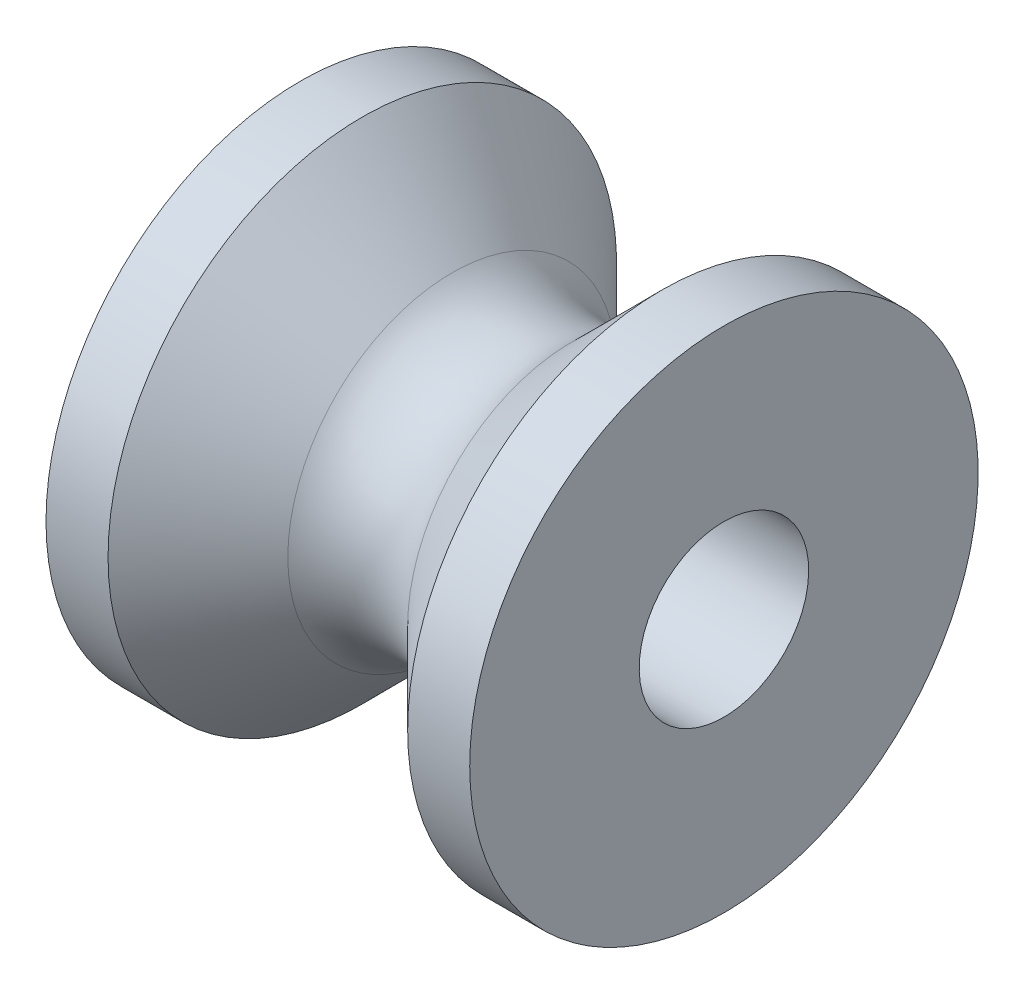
ISO-10303-21;
HEADER;
FILE_DESCRIPTION(('STEP AP214'),'2;1');
FILE_NAME('part.step','',(''),(''),'','','');
FILE_SCHEMA(('AUTOMOTIVE_DESIGN { 1 0 10303 214 1 1 1 1 }'));
ENDSEC;
DATA;
#1=APPLICATION_CONTEXT('core data for automotive mechanical design processes');
#2=APPLICATION_PROTOCOL_DEFINITION('international standard','automotive_design',2000,#1);
#3=PRODUCT_CONTEXT('',#1,'mechanical');
#4=PRODUCT('Part','Part','',(#3));
#5=PRODUCT_RELATED_PRODUCT_CATEGORY('part','',(#4));
#6=PRODUCT_DEFINITION_FORMATION('','',#4);
#7=PRODUCT_DEFINITION_CONTEXT('part definition',#1,'design');
#8=PRODUCT_DEFINITION('design','',#6,#7);
#9=PRODUCT_DEFINITION_SHAPE('','',#8);
#10=(LENGTH_UNIT() NAMED_UNIT(*) SI_UNIT(.MILLI.,.METRE.));
#11=(NAMED_UNIT(*) PLANE_ANGLE_UNIT() SI_UNIT($,.RADIAN.));
#12=(NAMED_UNIT(*) SI_UNIT($,.STERADIAN.) SOLID_ANGLE_UNIT());
#13=UNCERTAINTY_MEASURE_WITH_UNIT(LENGTH_MEASURE(1.E-05),#10,'distance_accuracy_value','');
#14=(GEOMETRIC_REPRESENTATION_CONTEXT(3) GLOBAL_UNCERTAINTY_ASSIGNED_CONTEXT((#13)) GLOBAL_UNIT_ASSIGNED_CONTEXT((#10,
#11,#12)) REPRESENTATION_CONTEXT('',''));
#15=CARTESIAN_POINT('',(0.,0.,0.));
#16=DIRECTION('',(0.,0.,1.));
#17=DIRECTION('',(1.,0.,0.));
#18=AXIS2_PLACEMENT_3D('',#15,#16,#17);
#19=CARTESIAN_POINT('',(0.,0.,0.));
#20=DIRECTION('',(-1.,0.,0.));
#21=DIRECTION('',(0.,0.,1.));
#22=AXIS2_PLACEMENT_3D('',#19,#20,#21);
#23=CONICAL_SURFACE('',#22,2.46446609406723,0.785398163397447);
#24=CARTESIAN_POINT('',(-1.41421356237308,0.,0.));
#25=DIRECTION('',(-1.,0.,0.));
#26=DIRECTION('',(0.,0.,1.));
#27=AXIS2_PLACEMENT_3D('',#24,#25,#26);
#28=CIRCLE('',#27,3.87867965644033);
#29=CARTESIAN_POINT('',(-1.41421356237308,0.,3.87867965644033));
#30=VERTEX_POINT('',#29);
#31=EDGE_CURVE('E38',#30,#30,#28,.T.);
#32=ORIENTED_EDGE('',*,*,#31,.T.);
#33=EDGE_LOOP('',(#32));
#34=FACE_BOUND('',#33,.T.);
#35=CARTESIAN_POINT('',(-3.53553390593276,0.,0.));
#36=DIRECTION('',(-1.,0.,0.));
#37=DIRECTION('',(0.,0.,1.));
#38=AXIS2_PLACEMENT_3D('',#35,#36,#37);
#39=CIRCLE('',#38,6.);
#40=CARTESIAN_POINT('',(-3.53553390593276,0.,6.));
#41=VERTEX_POINT('',#40);
#42=EDGE_CURVE('E54',#41,#41,#39,.T.);
#43=ORIENTED_EDGE('',*,*,#42,.F.);
#44=EDGE_LOOP('',(#43));
#45=FACE_BOUND('',#44,.T.);
#46=ADVANCED_FACE('F31',(#34,#45),#23,.T.);
#47=CARTESIAN_POINT('',(3.53553390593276,0.,0.));
#48=DIRECTION('',(1.,0.,0.));
#49=DIRECTION('',(0.,0.,-1.));
#50=AXIS2_PLACEMENT_3D('',#47,#48,#49);
#51=CONICAL_SURFACE('',#50,6.,0.785398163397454);
#52=CARTESIAN_POINT('',(1.41421356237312,0.,0.));
#53=DIRECTION('',(1.,0.,0.));
#54=DIRECTION('',(0.,0.,-1.));
#55=AXIS2_PLACEMENT_3D('',#52,#53,#54);
#56=CIRCLE('',#55,3.87867965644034);
#57=CARTESIAN_POINT('',(1.41421356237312,0.,-3.87867965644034));
#58=VERTEX_POINT('',#57);
#59=EDGE_CURVE('E10',#58,#58,#56,.T.);
#60=ORIENTED_EDGE('',*,*,#59,.T.);
#61=EDGE_LOOP('',(#60));
#62=FACE_BOUND('',#61,.T.);
#63=CARTESIAN_POINT('',(3.53553390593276,0.,0.));
#64=DIRECTION('',(-1.,0.,0.));
#65=DIRECTION('',(0.,0.,1.));
#66=AXIS2_PLACEMENT_3D('',#63,#64,#65);
#67=CIRCLE('',#66,6.);
#68=CARTESIAN_POINT('',(3.53553390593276,0.,6.));
#69=VERTEX_POINT('',#68);
#70=EDGE_CURVE('E42',#69,#69,#67,.T.);
#71=ORIENTED_EDGE('',*,*,#70,.T.);
#72=EDGE_LOOP('',(#71));
#73=FACE_BOUND('',#72,.T.);
#74=ADVANCED_FACE('F82',(#62,#73),#51,.T.);
#75=CARTESIAN_POINT('',(-5.,0.,0.));
#76=DIRECTION('',(-1.,0.,0.));
#77=DIRECTION('',(0.,0.,1.));
#78=AXIS2_PLACEMENT_3D('',#75,#76,#77);
#79=CYLINDRICAL_SURFACE('',#78,5.99999999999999);
#80=ORIENTED_EDGE('',*,*,#70,.F.);
#81=EDGE_LOOP('',(#80));
#82=FACE_BOUND('',#81,.T.);
#83=CARTESIAN_POINT('',(5.,0.,0.));
#84=DIRECTION('',(-1.,0.,0.));
#85=DIRECTION('',(0.,0.,1.));
#86=AXIS2_PLACEMENT_3D('',#83,#84,#85);
#87=CIRCLE('',#86,5.99999999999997);
#88=CARTESIAN_POINT('',(5.,0.,5.99999999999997));
#89=VERTEX_POINT('',#88);
#90=EDGE_CURVE('E46',#89,#89,#87,.T.);
#91=ORIENTED_EDGE('',*,*,#90,.T.);
#92=EDGE_LOOP('',(#91));
#93=FACE_BOUND('',#92,.T.);
#94=ADVANCED_FACE('F77',(#82,#93),#79,.T.);
#95=CARTESIAN_POINT('',(5.,0.,0.));
#96=DIRECTION('',(-1.,0.,0.));
#97=DIRECTION('',(0.,0.,1.));
#98=AXIS2_PLACEMENT_3D('',#95,#96,#97);
#99=PLANE('',#98);
#100=CARTESIAN_POINT('',(5.,0.,0.));
#101=DIRECTION('',(1.,0.,0.));
#102=DIRECTION('',(0.,1.,0.));
#103=AXIS2_PLACEMENT_3D('',#100,#101,#102);
#104=CIRCLE('',#103,2.);
#105=CARTESIAN_POINT('',(5.,2.,0.));
#106=VERTEX_POINT('',#105);
#107=EDGE_CURVE('E58',#106,#106,#104,.T.);
#108=ORIENTED_EDGE('',*,*,#107,.F.);
#109=EDGE_LOOP('',(#108));
#110=FACE_BOUND('',#109,.T.);
#111=ORIENTED_EDGE('',*,*,#90,.F.);
#112=EDGE_LOOP('',(#111));
#113=FACE_BOUND('',#112,.T.);
#114=ADVANCED_FACE('F74',(#110,#113),#99,.F.);
#115=CARTESIAN_POINT('',(-5.,5.99999999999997,0.));
#116=DIRECTION('',(1.,0.,0.));
#117=DIRECTION('',(0.,0.,-1.));
#118=AXIS2_PLACEMENT_3D('',#115,#116,#117);
#119=PLANE('',#118);
#120=CARTESIAN_POINT('',(-5.,0.,0.));
#121=DIRECTION('',(1.,0.,0.));
#122=DIRECTION('',(0.,1.,0.));
#123=AXIS2_PLACEMENT_3D('',#120,#121,#122);
#124=CIRCLE('',#123,2.);
#125=CARTESIAN_POINT('',(-5.,2.,0.));
#126=VERTEX_POINT('',#125);
#127=EDGE_CURVE('E57',#126,#126,#124,.T.);
#128=ORIENTED_EDGE('',*,*,#127,.T.);
#129=EDGE_LOOP('',(#128));
#130=FACE_BOUND('',#129,.T.);
#131=CARTESIAN_POINT('',(-5.,0.,0.));
#132=DIRECTION('',(-1.,0.,0.));
#133=DIRECTION('',(0.,0.,1.));
#134=AXIS2_PLACEMENT_3D('',#131,#132,#133);
#135=CIRCLE('',#134,5.99999999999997);
#136=CARTESIAN_POINT('',(-5.,0.,5.99999999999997));
#137=VERTEX_POINT('',#136);
#138=EDGE_CURVE('E51',#137,#137,#135,.T.);
#139=ORIENTED_EDGE('',*,*,#138,.T.);
#140=EDGE_LOOP('',(#139));
#141=FACE_BOUND('',#140,.T.);
#142=ADVANCED_FACE('F64',(#130,#141),#119,.F.);
#143=CARTESIAN_POINT('',(-5.,0.,0.));
#144=DIRECTION('',(-1.,0.,0.));
#145=DIRECTION('',(0.,0.,1.));
#146=AXIS2_PLACEMENT_3D('',#143,#144,#145);
#147=CYLINDRICAL_SURFACE('',#146,5.99999999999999);
#148=ORIENTED_EDGE('',*,*,#138,.F.);
#149=EDGE_LOOP('',(#148));
#150=FACE_BOUND('',#149,.T.);
#151=ORIENTED_EDGE('',*,*,#42,.T.);
#152=EDGE_LOOP('',(#151));
#153=FACE_BOUND('',#152,.T.);
#154=ADVANCED_FACE('F70',(#150,#153),#147,.T.);
#155=CARTESIAN_POINT('',(-5.,0.,0.));
#156=DIRECTION('',(1.,0.,0.));
#157=DIRECTION('',(0.,1.,0.));
#158=AXIS2_PLACEMENT_3D('',#155,#156,#157);
#159=CYLINDRICAL_SURFACE('',#158,2.);
#160=ORIENTED_EDGE('',*,*,#127,.F.);
#161=EDGE_LOOP('',(#160));
#162=FACE_BOUND('',#161,.T.);
#163=ORIENTED_EDGE('',*,*,#107,.T.);
#164=EDGE_LOOP('',(#163));
#165=FACE_BOUND('',#164,.T.);
#166=ADVANCED_FACE('F67',(#162,#165),#159,.F.);
#167=CARTESIAN_POINT('',(0.,0.,0.));
#168=DIRECTION('',(-1.,0.,0.));
#169=DIRECTION('',(0.,0.,1.));
#170=AXIS2_PLACEMENT_3D('',#167,#168,#169);
#171=TOROIDAL_SURFACE('',#170,5.29289321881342,2.);
#172=ORIENTED_EDGE('',*,*,#59,.F.);
#173=EDGE_LOOP('',(#172));
#174=FACE_BOUND('',#173,.T.);
#175=ORIENTED_EDGE('',*,*,#31,.F.);
#176=EDGE_LOOP('',(#175));
#177=FACE_BOUND('',#176,.T.);
#178=ADVANCED_FACE('F33',(#174,#177),#171,.F.);
#179=CLOSED_SHELL('',(#46,#74,#94,#114,#142,#154,#166,#178));
#180=MANIFOLD_SOLID_BREP('B2',#179);
#181=ADVANCED_BREP_SHAPE_REPRESENTATION('',(#18,#180),#14);
#182=SHAPE_DEFINITION_REPRESENTATION(#9,#181);
ENDSEC;
END-ISO-10303-21;
